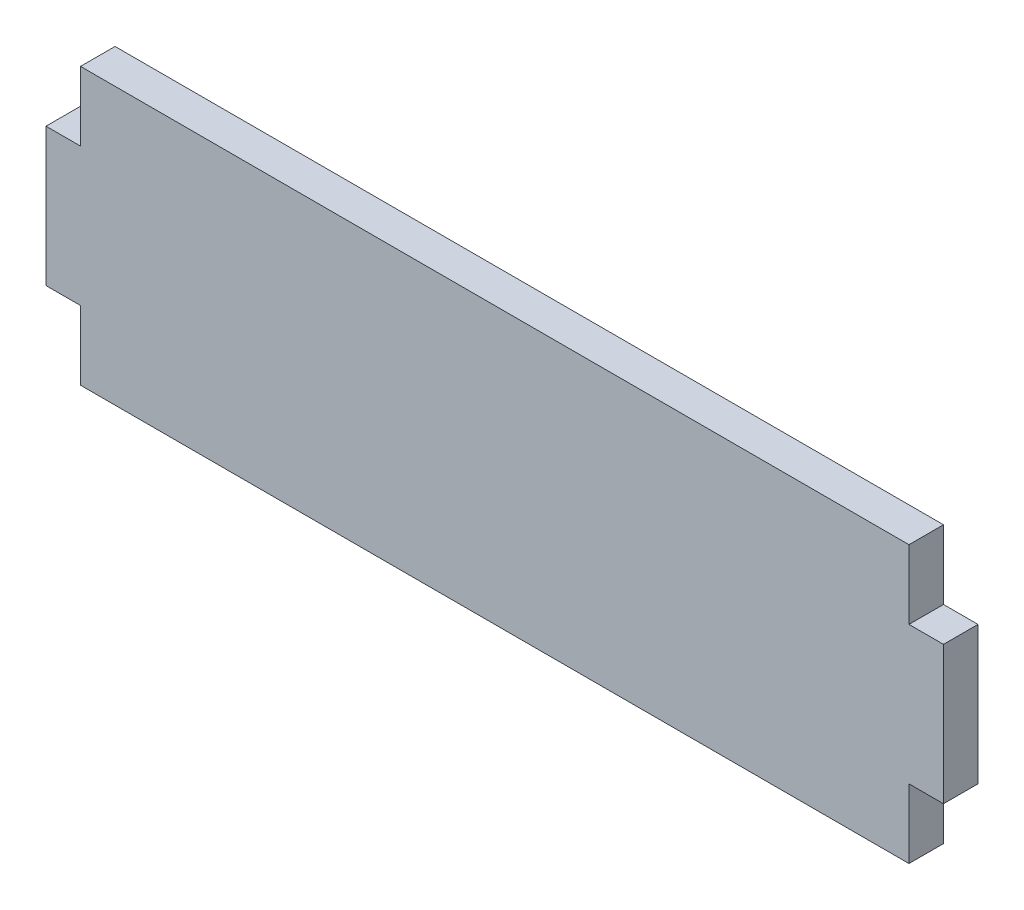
from build123d import *

# Parameters (mm, degrees)
BOSS_EXTRUDE1_DEPTH = 3.175


with BuildPart() as part:
    # Sketch1 → Boss-Extrude1 (new body)
    with BuildSketch(Plane.XY):
        Polygon((0, 0), (0, 12.7), (-38.1, 12.7), (-38.1, 6.35), (-41.275, 6.35), (-41.275, 0), align=None)
        Polygon((38.1, 12.7), (0, 12.7), (0, 0), (41.275, 0), (41.275, 6.35), (38.1, 6.35), align=None)
        Polygon((41.275, 0), (0, 0), (0, -12.7), (38.1, -12.7), (38.1, -6.35), (41.275, -6.35), align=None)
        Polygon((0, -12.7), (0, 0), (-41.275, 0), (-41.275, -6.35), (-38.1, -6.35), (-38.1, -12.7), align=None)
    extrude(amount=BOSS_EXTRUDE1_DEPTH)


solid = part.part
